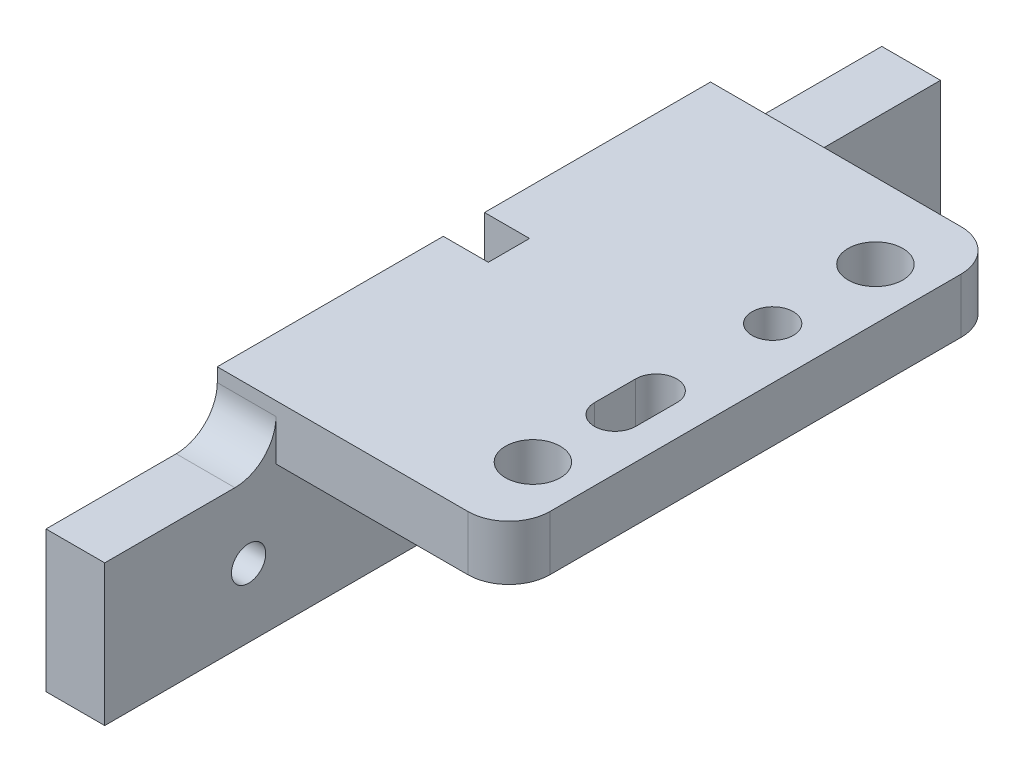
ISO-10303-21;
HEADER;
FILE_DESCRIPTION(('STEP AP214'),'2;1');
FILE_NAME('part.step','',(''),(''),'','','');
FILE_SCHEMA(('AUTOMOTIVE_DESIGN { 1 0 10303 214 1 1 1 1 }'));
ENDSEC;
DATA;
#1=APPLICATION_CONTEXT('core data for automotive mechanical design processes');
#2=APPLICATION_PROTOCOL_DEFINITION('international standard','automotive_design',2000,#1);
#3=PRODUCT_CONTEXT('',#1,'mechanical');
#4=PRODUCT('Part','Part','',(#3));
#5=PRODUCT_RELATED_PRODUCT_CATEGORY('part','',(#4));
#6=PRODUCT_DEFINITION_FORMATION('','',#4);
#7=PRODUCT_DEFINITION_CONTEXT('part definition',#1,'design');
#8=PRODUCT_DEFINITION('design','',#6,#7);
#9=PRODUCT_DEFINITION_SHAPE('','',#8);
#10=(LENGTH_UNIT() NAMED_UNIT(*) SI_UNIT(.MILLI.,.METRE.));
#11=(NAMED_UNIT(*) PLANE_ANGLE_UNIT() SI_UNIT($,.RADIAN.));
#12=(NAMED_UNIT(*) SI_UNIT($,.STERADIAN.) SOLID_ANGLE_UNIT());
#13=UNCERTAINTY_MEASURE_WITH_UNIT(LENGTH_MEASURE(1.E-05),#10,'distance_accuracy_value','');
#14=(GEOMETRIC_REPRESENTATION_CONTEXT(3) GLOBAL_UNCERTAINTY_ASSIGNED_CONTEXT((#13)) GLOBAL_UNIT_ASSIGNED_CONTEXT((#10,
#11,#12)) REPRESENTATION_CONTEXT('',''));
#15=CARTESIAN_POINT('',(0.,0.,0.));
#16=DIRECTION('',(0.,0.,1.));
#17=DIRECTION('',(1.,0.,0.));
#18=AXIS2_PLACEMENT_3D('',#15,#16,#17);
#19=CARTESIAN_POINT('',(-10.643,-7.1435,30.5));
#20=DIRECTION('',(1.,0.,0.));
#21=DIRECTION('',(0.,0.,-1.));
#22=AXIS2_PLACEMENT_3D('',#19,#20,#21);
#23=PLANE('',#22);
#24=CARTESIAN_POINT('',(-10.643,-2.14349999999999,-20.));
#25=DIRECTION('',(1.,0.,0.));
#26=DIRECTION('',(0.,0.,-1.));
#27=AXIS2_PLACEMENT_3D('',#24,#25,#26);
#28=CIRCLE('',#27,1.25);
#29=CARTESIAN_POINT('',(-10.643,-2.14349999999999,-21.25));
#30=VERTEX_POINT('',#29);
#31=EDGE_CURVE('E319',#30,#30,#28,.T.);
#32=ORIENTED_EDGE('',*,*,#31,.T.);
#33=EDGE_LOOP('',(#32));
#34=FACE_BOUND('',#33,.T.);
#35=DIRECTION('',(0.,-1.,0.));
#36=VECTOR('',#35,1.);
#37=CARTESIAN_POINT('',(-10.643,7.1435,-18.));
#38=LINE('',#37,#36);
#39=CARTESIAN_POINT('',(-10.643,7.1435,-18.));
#40=VERTEX_POINT('',#39);
#41=CARTESIAN_POINT('',(-10.643,6.1435,-18.));
#42=VERTEX_POINT('',#41);
#43=EDGE_CURVE('E259',#40,#42,#38,.T.);
#44=ORIENTED_EDGE('',*,*,#43,.T.);
#45=CARTESIAN_POINT('',(-10.643,6.1435,-21.));
#46=DIRECTION('',(1.,0.,0.));
#47=DIRECTION('',(0.,0.,-1.));
#48=AXIS2_PLACEMENT_3D('',#45,#46,#47);
#49=CIRCLE('',#48,3.);
#50=CARTESIAN_POINT('',(-10.643,3.1435,-21.));
#51=VERTEX_POINT('',#50);
#52=EDGE_CURVE('E455',#42,#51,#49,.T.);
#53=ORIENTED_EDGE('',*,*,#52,.T.);
#54=DIRECTION('',(0.,0.,-1.));
#55=VECTOR('',#54,1.);
#56=CARTESIAN_POINT('',(-10.643,3.1435,-30.5));
#57=LINE('',#56,#55);
#58=CARTESIAN_POINT('',(-10.643,3.1435,-30.5));
#59=VERTEX_POINT('',#58);
#60=EDGE_CURVE('E263',#51,#59,#57,.T.);
#61=ORIENTED_EDGE('',*,*,#60,.T.);
#62=DIRECTION('',(0.,-1.,0.));
#63=VECTOR('',#62,1.);
#64=CARTESIAN_POINT('',(-10.643,-7.1435,-30.5));
#65=LINE('',#64,#63);
#66=CARTESIAN_POINT('',(-10.643,-7.1435,-30.5));
#67=VERTEX_POINT('',#66);
#68=EDGE_CURVE('E372',#59,#67,#65,.T.);
#69=ORIENTED_EDGE('',*,*,#68,.T.);
#70=DIRECTION('',(0.,0.,-1.));
#71=VECTOR('',#70,1.);
#72=CARTESIAN_POINT('',(-10.643,-7.1435,30.5));
#73=LINE('',#72,#71);
#74=CARTESIAN_POINT('',(-10.643,-7.1435,-1.50495));
#75=VERTEX_POINT('',#74);
#76=EDGE_CURVE('E388',#75,#67,#73,.T.);
#77=ORIENTED_EDGE('',*,*,#76,.F.);
#78=DIRECTION('',(0.,-1.,0.));
#79=VECTOR('',#78,1.);
#80=CARTESIAN_POINT('',(-10.643,7.1435,-1.50495));
#81=LINE('',#80,#79);
#82=CARTESIAN_POINT('',(-10.643,7.1435,-1.50495));
#83=VERTEX_POINT('',#82);
#84=EDGE_CURVE('E277',#83,#75,#81,.T.);
#85=ORIENTED_EDGE('',*,*,#84,.F.);
#86=DIRECTION('',(0.,0.,-1.));
#87=VECTOR('',#86,1.);
#88=CARTESIAN_POINT('',(-10.643,7.1435,30.5));
#89=LINE('',#88,#87);
#90=EDGE_CURVE('E398',#83,#40,#89,.T.);
#91=ORIENTED_EDGE('',*,*,#90,.T.);
#92=EDGE_LOOP('',(#44,#53,#61,#69,#77,#85,#91));
#93=FACE_BOUND('',#92,.T.);
#94=ADVANCED_FACE('F44',(#34,#93),#23,.F.);
#95=CARTESIAN_POINT('',(10.643,-7.1435,30.5));
#96=DIRECTION('',(-1.,0.,0.));
#97=DIRECTION('',(0.,0.,1.));
#98=AXIS2_PLACEMENT_3D('',#95,#96,#97);
#99=PLANE('',#98);
#100=DIRECTION('',(0.,0.,-1.));
#101=VECTOR('',#100,1.);
#102=CARTESIAN_POINT('',(10.643,7.1435,30.5));
#103=LINE('',#102,#101);
#104=CARTESIAN_POINT('',(10.643,7.1435,15.));
#105=VERTEX_POINT('',#104);
#106=CARTESIAN_POINT('',(10.643,7.1435,-15.));
#107=VERTEX_POINT('',#106);
#108=EDGE_CURVE('E402',#105,#107,#103,.T.);
#109=ORIENTED_EDGE('',*,*,#108,.F.);
#110=DIRECTION('',(0.,-1.,0.));
#111=VECTOR('',#110,1.);
#112=CARTESIAN_POINT('',(10.643,-7.1435,15.));
#113=LINE('',#112,#111);
#114=CARTESIAN_POINT('',(10.643,3.1435,15.));
#115=VERTEX_POINT('',#114);
#116=EDGE_CURVE('E408',#105,#115,#113,.T.);
#117=ORIENTED_EDGE('',*,*,#116,.T.);
#118=DIRECTION('',(0.,0.,1.));
#119=VECTOR('',#118,1.);
#120=CARTESIAN_POINT('',(10.643,3.1435,-30.5));
#121=LINE('',#120,#119);
#122=CARTESIAN_POINT('',(10.643,3.1435,-15.));
#123=VERTEX_POINT('',#122);
#124=EDGE_CURVE('E365',#123,#115,#121,.T.);
#125=ORIENTED_EDGE('',*,*,#124,.F.);
#126=DIRECTION('',(0.,-1.,0.));
#127=VECTOR('',#126,1.);
#128=CARTESIAN_POINT('',(10.643,-7.1435,-15.));
#129=LINE('',#128,#127);
#130=EDGE_CURVE('E406',#123,#107,#129,.F.);
#131=ORIENTED_EDGE('',*,*,#130,.T.);
#132=EDGE_LOOP('',(#109,#117,#125,#131));
#133=FACE_BOUND('',#132,.T.);
#134=ADVANCED_FACE('F534',(#133),#99,.F.);
#135=CARTESIAN_POINT('',(-10.643,7.1435,30.5));
#136=DIRECTION('',(0.,-1.,0.));
#137=DIRECTION('',(0.,0.,-1.));
#138=AXIS2_PLACEMENT_3D('',#135,#136,#137);
#139=PLANE('',#138);
#140=CARTESIAN_POINT('',(6.89300000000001,7.1435,-5.));
#141=DIRECTION('',(0.,-1.,0.));
#142=DIRECTION('',(-1.,0.,0.));
#143=AXIS2_PLACEMENT_3D('',#140,#141,#142);
#144=CIRCLE('',#143,1.50495);
#145=CARTESIAN_POINT('',(5.38805000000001,7.1435,-5.));
#146=VERTEX_POINT('',#145);
#147=EDGE_CURVE('E273',#146,#146,#144,.T.);
#148=ORIENTED_EDGE('',*,*,#147,.T.);
#149=EDGE_LOOP('',(#148));
#150=FACE_BOUND('',#149,.T.);
#151=CARTESIAN_POINT('',(6.89300000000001,7.14350000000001,6.5));
#152=DIRECTION('',(0.,-1.,0.));
#153=DIRECTION('',(1.,0.,0.));
#154=AXIS2_PLACEMENT_3D('',#151,#152,#153);
#155=CIRCLE('',#154,1.50495);
#156=CARTESIAN_POINT('',(8.39795000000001,7.1435,6.5));
#157=VERTEX_POINT('',#156);
#158=CARTESIAN_POINT('',(5.38805000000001,7.14350000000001,6.5));
#159=VERTEX_POINT('',#158);
#160=EDGE_CURVE('E60',#157,#159,#155,.T.);
#161=ORIENTED_EDGE('',*,*,#160,.T.);
#162=DIRECTION('',(0.,0.,-1.));
#163=VECTOR('',#162,1.);
#164=CARTESIAN_POINT('',(5.38805000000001,7.14350000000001,3.5));
#165=LINE('',#164,#163);
#166=CARTESIAN_POINT('',(5.38805000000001,7.14350000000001,3.5));
#167=VERTEX_POINT('',#166);
#168=EDGE_CURVE('E210',#159,#167,#165,.T.);
#169=ORIENTED_EDGE('',*,*,#168,.T.);
#170=CARTESIAN_POINT('',(6.89300000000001,7.14350000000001,3.5));
#171=DIRECTION('',(0.,-1.,0.));
#172=DIRECTION('',(1.,0.,0.));
#173=AXIS2_PLACEMENT_3D('',#170,#171,#172);
#174=CIRCLE('',#173,1.50495);
#175=CARTESIAN_POINT('',(8.39795000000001,7.14350000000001,3.5));
#176=VERTEX_POINT('',#175);
#177=EDGE_CURVE('E204',#167,#176,#174,.T.);
#178=ORIENTED_EDGE('',*,*,#177,.T.);
#179=DIRECTION('',(0.,0.,1.));
#180=VECTOR('',#179,1.);
#181=CARTESIAN_POINT('',(8.39795000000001,7.14350000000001,3.5));
#182=LINE('',#181,#180);
#183=EDGE_CURVE('E196',#176,#157,#182,.T.);
#184=ORIENTED_EDGE('',*,*,#183,.T.);
#185=EDGE_LOOP('',(#161,#169,#178,#184));
#186=FACE_BOUND('',#185,.T.);
#187=CARTESIAN_POINT('',(-10.643,7.14349999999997,18.));
#188=VERTEX_POINT('',#187);
#189=CARTESIAN_POINT('',(-10.643,7.1435,1.50495));
#190=VERTEX_POINT('',#189);
#191=EDGE_CURVE('E399',#188,#190,#89,.T.);
#192=ORIENTED_EDGE('',*,*,#191,.F.);
#193=DIRECTION('',(1.,0.,0.));
#194=VECTOR('',#193,1.);
#195=CARTESIAN_POINT('',(10.643,7.1435,18.));
#196=LINE('',#195,#194);
#197=CARTESIAN_POINT('',(7.643,7.1435,18.));
#198=VERTEX_POINT('',#197);
#199=EDGE_CURVE('E354',#188,#198,#196,.T.);
#200=ORIENTED_EDGE('',*,*,#199,.T.);
#201=CARTESIAN_POINT('',(7.643,7.1435,15.));
#202=DIRECTION('',(0.,-1.,0.));
#203=DIRECTION('',(0.,0.,-1.));
#204=AXIS2_PLACEMENT_3D('',#201,#202,#203);
#205=CIRCLE('',#204,3.);
#206=EDGE_CURVE('E424',#198,#105,#205,.F.);
#207=ORIENTED_EDGE('',*,*,#206,.T.);
#208=ORIENTED_EDGE('',*,*,#108,.T.);
#209=CARTESIAN_POINT('',(7.643,7.1435,-15.));
#210=DIRECTION('',(0.,-1.,0.));
#211=DIRECTION('',(0.,0.,-1.));
#212=AXIS2_PLACEMENT_3D('',#209,#210,#211);
#213=CIRCLE('',#212,3.);
#214=CARTESIAN_POINT('',(7.643,7.1435,-18.));
#215=VERTEX_POINT('',#214);
#216=EDGE_CURVE('E421',#107,#215,#213,.F.);
#217=ORIENTED_EDGE('',*,*,#216,.T.);
#218=DIRECTION('',(-1.,0.,0.));
#219=VECTOR('',#218,1.);
#220=CARTESIAN_POINT('',(10.643,7.1435,-18.));
#221=LINE('',#220,#219);
#222=EDGE_CURVE('E347',#215,#40,#221,.T.);
#223=ORIENTED_EDGE('',*,*,#222,.T.);
#224=ORIENTED_EDGE('',*,*,#90,.F.);
#225=DIRECTION('',(-1.,0.,0.));
#226=VECTOR('',#225,1.);
#227=CARTESIAN_POINT('',(8.24361187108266,7.1435,-1.50495));
#228=LINE('',#227,#226);
#229=CARTESIAN_POINT('',(-7.357,7.1435,-1.50495));
#230=VERTEX_POINT('',#229);
#231=EDGE_CURVE('E285',#230,#83,#228,.T.);
#232=ORIENTED_EDGE('',*,*,#231,.F.);
#233=DIRECTION('',(0.,0.,1.));
#234=VECTOR('',#233,1.);
#235=CARTESIAN_POINT('',(-7.357,7.1435,-1.50495));
#236=LINE('',#235,#234);
#237=CARTESIAN_POINT('',(-7.357,7.1435,1.50495));
#238=VERTEX_POINT('',#237);
#239=EDGE_CURVE('E284',#230,#238,#236,.T.);
#240=ORIENTED_EDGE('',*,*,#239,.T.);
#241=DIRECTION('',(-1.,0.,0.));
#242=VECTOR('',#241,1.);
#243=CARTESIAN_POINT('',(8.24361187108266,7.1435,1.50495));
#244=LINE('',#243,#242);
#245=EDGE_CURVE('E302',#238,#190,#244,.T.);
#246=ORIENTED_EDGE('',*,*,#245,.T.);
#247=EDGE_LOOP('',(#192,#200,#207,#208,#217,#223,#224,#232,#240,#246));
#248=FACE_BOUND('',#247,.T.);
#249=CARTESIAN_POINT('',(6.89300000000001,7.1435,-12.5));
#250=DIRECTION('',(0.,-1.,0.));
#251=DIRECTION('',(0.,0.,-1.));
#252=AXIS2_PLACEMENT_3D('',#249,#250,#251);
#253=CIRCLE('',#252,2.);
#254=CARTESIAN_POINT('',(6.89300000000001,7.1435,-14.5));
#255=VERTEX_POINT('',#254);
#256=EDGE_CURVE('E334',#255,#255,#253,.T.);
#257=ORIENTED_EDGE('',*,*,#256,.T.);
#258=EDGE_LOOP('',(#257));
#259=FACE_BOUND('',#258,.T.);
#260=CARTESIAN_POINT('',(6.89300000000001,7.1435,12.5));
#261=DIRECTION('',(0.,-1.,0.));
#262=DIRECTION('',(0.,0.,-1.));
#263=AXIS2_PLACEMENT_3D('',#260,#261,#262);
#264=CIRCLE('',#263,2.);
#265=CARTESIAN_POINT('',(6.89300000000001,7.1435,10.5));
#266=VERTEX_POINT('',#265);
#267=EDGE_CURVE('E342',#266,#266,#264,.T.);
#268=ORIENTED_EDGE('',*,*,#267,.T.);
#269=EDGE_LOOP('',(#268));
#270=FACE_BOUND('',#269,.T.);
#271=ADVANCED_FACE('F212',(#150,#186,#248,#259,#270),#139,.F.);
#272=CARTESIAN_POINT('',(-10.643,-2.1435,20.));
#273=DIRECTION('',(1.,0.,0.));
#274=DIRECTION('',(0.,0.,-1.));
#275=AXIS2_PLACEMENT_3D('',#272,#273,#274);
#276=CIRCLE('',#275,1.25);
#277=CARTESIAN_POINT('',(-10.643,-2.1435,18.75));
#278=VERTEX_POINT('',#277);
#279=EDGE_CURVE('E327',#278,#278,#276,.T.);
#280=ORIENTED_EDGE('',*,*,#279,.T.);
#281=EDGE_LOOP('',(#280));
#282=FACE_BOUND('',#281,.T.);
#283=DIRECTION('',(0.,0.,-1.));
#284=VECTOR('',#283,1.);
#285=CARTESIAN_POINT('',(-10.643,3.14349999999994,30.5));
#286=LINE('',#285,#284);
#287=CARTESIAN_POINT('',(-10.643,3.14349999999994,30.5));
#288=VERTEX_POINT('',#287);
#289=CARTESIAN_POINT('',(-10.643,3.14349999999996,21.));
#290=VERTEX_POINT('',#289);
#291=EDGE_CURVE('E245',#288,#290,#286,.T.);
#292=ORIENTED_EDGE('',*,*,#291,.T.);
#293=CARTESIAN_POINT('',(-10.643,6.14349999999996,21.));
#294=DIRECTION('',(1.,0.,0.));
#295=DIRECTION('',(0.,0.,-1.));
#296=AXIS2_PLACEMENT_3D('',#293,#294,#295);
#297=CIRCLE('',#296,3.);
#298=CARTESIAN_POINT('',(-10.643,6.14349999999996,18.));
#299=VERTEX_POINT('',#298);
#300=EDGE_CURVE('E12',#290,#299,#297,.T.);
#301=ORIENTED_EDGE('',*,*,#300,.T.);
#302=DIRECTION('',(0.,1.,0.));
#303=VECTOR('',#302,1.);
#304=CARTESIAN_POINT('',(-10.643,7.14349999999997,18.));
#305=LINE('',#304,#303);
#306=EDGE_CURVE('E249',#299,#188,#305,.T.);
#307=ORIENTED_EDGE('',*,*,#306,.T.);
#308=ORIENTED_EDGE('',*,*,#191,.T.);
#309=DIRECTION('',(0.,1.,0.));
#310=VECTOR('',#309,1.);
#311=CARTESIAN_POINT('',(-10.643,7.1435,1.50495));
#312=LINE('',#311,#310);
#313=CARTESIAN_POINT('',(-10.643,-7.1435,1.50495));
#314=VERTEX_POINT('',#313);
#315=EDGE_CURVE('E295',#314,#190,#312,.T.);
#316=ORIENTED_EDGE('',*,*,#315,.F.);
#317=CARTESIAN_POINT('',(-10.643,-7.1435,30.5));
#318=VERTEX_POINT('',#317);
#319=EDGE_CURVE('E394',#318,#314,#73,.T.);
#320=ORIENTED_EDGE('',*,*,#319,.F.);
#321=DIRECTION('',(0.,-1.,0.));
#322=VECTOR('',#321,1.);
#323=CARTESIAN_POINT('',(-10.643,-7.1435,30.5));
#324=LINE('',#323,#322);
#325=EDGE_CURVE('E380',#288,#318,#324,.T.);
#326=ORIENTED_EDGE('',*,*,#325,.F.);
#327=EDGE_LOOP('',(#292,#301,#307,#308,#316,#320,#326));
#328=FACE_BOUND('',#327,.T.);
#329=ADVANCED_FACE('F472',(#282,#328),#23,.F.);
#330=CARTESIAN_POINT('',(-10.643,-7.1435,30.5));
#331=DIRECTION('',(0.,1.,0.));
#332=DIRECTION('',(0.,0.,1.));
#333=AXIS2_PLACEMENT_3D('',#330,#331,#332);
#334=PLANE('',#333);
#335=DIRECTION('',(0.,0.,-1.));
#336=VECTOR('',#335,1.);
#337=CARTESIAN_POINT('',(-7.357,-7.1435,-1.50495));
#338=LINE('',#337,#336);
#339=CARTESIAN_POINT('',(-7.357,-7.1435,1.50495));
#340=VERTEX_POINT('',#339);
#341=CARTESIAN_POINT('',(-7.357,-7.1435,-1.50495));
#342=VERTEX_POINT('',#341);
#343=EDGE_CURVE('E292',#340,#342,#338,.T.);
#344=ORIENTED_EDGE('',*,*,#343,.T.);
#345=DIRECTION('',(-1.,0.,0.));
#346=VECTOR('',#345,1.);
#347=CARTESIAN_POINT('',(8.24361187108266,-7.1435,-1.50495));
#348=LINE('',#347,#346);
#349=EDGE_CURVE('E299',#342,#75,#348,.T.);
#350=ORIENTED_EDGE('',*,*,#349,.T.);
#351=ORIENTED_EDGE('',*,*,#76,.T.);
#352=DIRECTION('',(1.,0.,0.));
#353=VECTOR('',#352,1.);
#354=CARTESIAN_POINT('',(-10.643,-7.1435,-30.5));
#355=LINE('',#354,#353);
#356=CARTESIAN_POINT('',(-6.357,-7.1435,-30.5));
#357=VERTEX_POINT('',#356);
#358=EDGE_CURVE('E384',#67,#357,#355,.T.);
#359=ORIENTED_EDGE('',*,*,#358,.T.);
#360=DIRECTION('',(0.,0.,1.));
#361=VECTOR('',#360,1.);
#362=CARTESIAN_POINT('',(-6.357,-7.1435,-30.5));
#363=LINE('',#362,#361);
#364=CARTESIAN_POINT('',(-6.357,-7.1435,30.5));
#365=VERTEX_POINT('',#364);
#366=EDGE_CURVE('E368',#357,#365,#363,.T.);
#367=ORIENTED_EDGE('',*,*,#366,.T.);
#368=DIRECTION('',(1.,0.,0.));
#369=VECTOR('',#368,1.);
#370=CARTESIAN_POINT('',(-10.643,-7.1435,30.5));
#371=LINE('',#370,#369);
#372=EDGE_CURVE('E383',#318,#365,#371,.T.);
#373=ORIENTED_EDGE('',*,*,#372,.F.);
#374=ORIENTED_EDGE('',*,*,#319,.T.);
#375=DIRECTION('',(-1.,0.,0.));
#376=VECTOR('',#375,1.);
#377=CARTESIAN_POINT('',(8.24361187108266,-7.1435,1.50495));
#378=LINE('',#377,#376);
#379=EDGE_CURVE('E306',#340,#314,#378,.T.);
#380=ORIENTED_EDGE('',*,*,#379,.F.);
#381=EDGE_LOOP('',(#344,#350,#351,#359,#367,#373,#374,#380));
#382=FACE_BOUND('',#381,.T.);
#383=ADVANCED_FACE('F489',(#382),#334,.F.);
#384=CARTESIAN_POINT('',(0.,0.,30.5));
#385=DIRECTION('',(0.,0.,-1.));
#386=DIRECTION('',(-1.,0.,0.));
#387=AXIS2_PLACEMENT_3D('',#384,#385,#386);
#388=PLANE('',#387);
#389=DIRECTION('',(0.,-1.,0.));
#390=VECTOR('',#389,1.);
#391=CARTESIAN_POINT('',(-6.357,-7.1435,30.5));
#392=LINE('',#391,#390);
#393=CARTESIAN_POINT('',(-6.357,3.14349999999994,30.5));
#394=VERTEX_POINT('',#393);
#395=EDGE_CURVE('E358',#394,#365,#392,.T.);
#396=ORIENTED_EDGE('',*,*,#395,.F.);
#397=DIRECTION('',(1.,0.,0.));
#398=VECTOR('',#397,1.);
#399=CARTESIAN_POINT('',(-10.643,3.14349999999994,30.5));
#400=LINE('',#399,#398);
#401=EDGE_CURVE('E252',#288,#394,#400,.T.);
#402=ORIENTED_EDGE('',*,*,#401,.F.);
#403=ORIENTED_EDGE('',*,*,#325,.T.);
#404=ORIENTED_EDGE('',*,*,#372,.T.);
#405=EDGE_LOOP('',(#396,#402,#403,#404));
#406=FACE_BOUND('',#405,.T.);
#407=ADVANCED_FACE('F492',(#406),#388,.F.);
#408=CARTESIAN_POINT('',(0.,0.,-30.5));
#409=DIRECTION('',(0.,0.,-1.));
#410=DIRECTION('',(-1.,0.,0.));
#411=AXIS2_PLACEMENT_3D('',#408,#409,#410);
#412=PLANE('',#411);
#413=DIRECTION('',(1.,0.,0.));
#414=VECTOR('',#413,1.);
#415=CARTESIAN_POINT('',(-10.643,3.1435,-30.5));
#416=LINE('',#415,#414);
#417=CARTESIAN_POINT('',(-6.357,3.1435,-30.5));
#418=VERTEX_POINT('',#417);
#419=EDGE_CURVE('E266',#59,#418,#416,.T.);
#420=ORIENTED_EDGE('',*,*,#419,.T.);
#421=DIRECTION('',(0.,-1.,0.));
#422=VECTOR('',#421,1.);
#423=CARTESIAN_POINT('',(-6.357,-7.1435,-30.5));
#424=LINE('',#423,#422);
#425=EDGE_CURVE('E362',#418,#357,#424,.T.);
#426=ORIENTED_EDGE('',*,*,#425,.T.);
#427=ORIENTED_EDGE('',*,*,#358,.F.);
#428=ORIENTED_EDGE('',*,*,#68,.F.);
#429=EDGE_LOOP('',(#420,#426,#427,#428));
#430=FACE_BOUND('',#429,.T.);
#431=ADVANCED_FACE('F500',(#430),#412,.T.);
#432=CARTESIAN_POINT('',(-6.357,-7.1435,-30.5));
#433=DIRECTION('',(-1.,0.,0.));
#434=DIRECTION('',(0.,0.,1.));
#435=AXIS2_PLACEMENT_3D('',#432,#433,#434);
#436=PLANE('',#435);
#437=CARTESIAN_POINT('',(-6.357,-2.14349999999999,-20.));
#438=DIRECTION('',(1.,0.,0.));
#439=DIRECTION('',(0.,0.,-1.));
#440=AXIS2_PLACEMENT_3D('',#437,#438,#439);
#441=CIRCLE('',#440,1.25);
#442=CARTESIAN_POINT('',(-6.357,-2.14349999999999,-21.25));
#443=VERTEX_POINT('',#442);
#444=EDGE_CURVE('E315',#443,#443,#441,.T.);
#445=ORIENTED_EDGE('',*,*,#444,.F.);
#446=EDGE_LOOP('',(#445));
#447=FACE_BOUND('',#446,.T.);
#448=CARTESIAN_POINT('',(-6.357,-2.1435,20.));
#449=DIRECTION('',(1.,0.,0.));
#450=DIRECTION('',(0.,0.,-1.));
#451=AXIS2_PLACEMENT_3D('',#448,#449,#450);
#452=CIRCLE('',#451,1.25);
#453=CARTESIAN_POINT('',(-6.357,-2.1435,18.75));
#454=VERTEX_POINT('',#453);
#455=EDGE_CURVE('E323',#454,#454,#452,.T.);
#456=ORIENTED_EDGE('',*,*,#455,.F.);
#457=EDGE_LOOP('',(#456));
#458=FACE_BOUND('',#457,.T.);
#459=DIRECTION('',(0.,0.,1.));
#460=VECTOR('',#459,1.);
#461=CARTESIAN_POINT('',(-6.357,3.1435,-30.5));
#462=LINE('',#461,#460);
#463=CARTESIAN_POINT('',(-6.357,3.1435,-18.));
#464=VERTEX_POINT('',#463);
#465=CARTESIAN_POINT('',(-6.357,3.1435,18.));
#466=VERTEX_POINT('',#465);
#467=EDGE_CURVE('E373',#464,#466,#462,.T.);
#468=ORIENTED_EDGE('',*,*,#467,.T.);
#469=DIRECTION('',(0.,-1.,0.));
#470=VECTOR('',#469,1.);
#471=CARTESIAN_POINT('',(-6.357,-7.1435,18.));
#472=LINE('',#471,#470);
#473=CARTESIAN_POINT('',(-6.357,6.14349999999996,18.));
#474=VERTEX_POINT('',#473);
#475=EDGE_CURVE('E442',#474,#466,#472,.T.);
#476=ORIENTED_EDGE('',*,*,#475,.F.);
#477=CARTESIAN_POINT('',(-6.357,6.14349999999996,21.));
#478=DIRECTION('',(-1.,0.,0.));
#479=DIRECTION('',(0.,0.,1.));
#480=AXIS2_PLACEMENT_3D('',#477,#478,#479);
#481=CIRCLE('',#480,3.);
#482=CARTESIAN_POINT('',(-6.357,3.14349999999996,21.));
#483=VERTEX_POINT('',#482);
#484=EDGE_CURVE('E53',#474,#483,#481,.T.);
#485=ORIENTED_EDGE('',*,*,#484,.T.);
#486=DIRECTION('',(0.,0.,-1.));
#487=VECTOR('',#486,1.);
#488=CARTESIAN_POINT('',(-6.357,3.14349999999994,30.5));
#489=LINE('',#488,#487);
#490=EDGE_CURVE('E238',#394,#483,#489,.T.);
#491=ORIENTED_EDGE('',*,*,#490,.F.);
#492=ORIENTED_EDGE('',*,*,#395,.T.);
#493=ORIENTED_EDGE('',*,*,#366,.F.);
#494=ORIENTED_EDGE('',*,*,#425,.F.);
#495=DIRECTION('',(0.,0.,-1.));
#496=VECTOR('',#495,1.);
#497=CARTESIAN_POINT('',(-6.357,3.1435,-30.5));
#498=LINE('',#497,#496);
#499=CARTESIAN_POINT('',(-6.357,3.1435,-21.));
#500=VERTEX_POINT('',#499);
#501=EDGE_CURVE('E258',#500,#418,#498,.T.);
#502=ORIENTED_EDGE('',*,*,#501,.F.);
#503=CARTESIAN_POINT('',(-6.357,6.1435,-21.));
#504=DIRECTION('',(-1.,0.,0.));
#505=DIRECTION('',(0.,0.,1.));
#506=AXIS2_PLACEMENT_3D('',#503,#504,#505);
#507=CIRCLE('',#506,3.);
#508=CARTESIAN_POINT('',(-6.357,6.1435,-18.));
#509=VERTEX_POINT('',#508);
#510=EDGE_CURVE('E452',#500,#509,#507,.T.);
#511=ORIENTED_EDGE('',*,*,#510,.T.);
#512=DIRECTION('',(0.,1.,0.));
#513=VECTOR('',#512,1.);
#514=CARTESIAN_POINT('',(-6.357,-7.1435,-18.));
#515=LINE('',#514,#513);
#516=EDGE_CURVE('E438',#464,#509,#515,.T.);
#517=ORIENTED_EDGE('',*,*,#516,.F.);
#518=EDGE_LOOP('',(#468,#476,#485,#491,#492,#493,#494,#502,#511,#517));
#519=FACE_BOUND('',#518,.T.);
#520=ADVANCED_FACE('F461',(#447,#458,#519),#436,.F.);
#521=CARTESIAN_POINT('',(10.643,3.1435,-30.5));
#522=DIRECTION('',(0.,1.,0.));
#523=DIRECTION('',(-1.,0.,0.));
#524=AXIS2_PLACEMENT_3D('',#521,#522,#523);
#525=PLANE('',#524);
#526=CARTESIAN_POINT('',(6.89300000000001,3.1435,-5.));
#527=DIRECTION('',(0.,-1.,0.));
#528=DIRECTION('',(-1.,0.,0.));
#529=AXIS2_PLACEMENT_3D('',#526,#527,#528);
#530=CIRCLE('',#529,1.50495);
#531=CARTESIAN_POINT('',(5.38805000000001,3.1435,-5.));
#532=VERTEX_POINT('',#531);
#533=EDGE_CURVE('E272',#532,#532,#530,.T.);
#534=ORIENTED_EDGE('',*,*,#533,.F.);
#535=EDGE_LOOP('',(#534));
#536=FACE_BOUND('',#535,.T.);
#537=DIRECTION('',(0.,0.,1.));
#538=VECTOR('',#537,1.);
#539=CARTESIAN_POINT('',(8.39795000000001,3.1435,3.5));
#540=LINE('',#539,#538);
#541=CARTESIAN_POINT('',(8.39795000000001,3.1435,3.5));
#542=VERTEX_POINT('',#541);
#543=CARTESIAN_POINT('',(8.39795000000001,3.1435,6.5));
#544=VERTEX_POINT('',#543);
#545=EDGE_CURVE('E229',#542,#544,#540,.T.);
#546=ORIENTED_EDGE('',*,*,#545,.F.);
#547=CARTESIAN_POINT('',(6.89300000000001,3.1435,3.5));
#548=DIRECTION('',(0.,-1.,0.));
#549=DIRECTION('',(1.,0.,0.));
#550=AXIS2_PLACEMENT_3D('',#547,#548,#549);
#551=CIRCLE('',#550,1.50495);
#552=CARTESIAN_POINT('',(5.38805000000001,3.1435,3.5));
#553=VERTEX_POINT('',#552);
#554=EDGE_CURVE('E68',#553,#542,#551,.T.);
#555=ORIENTED_EDGE('',*,*,#554,.F.);
#556=DIRECTION('',(0.,0.,-1.));
#557=VECTOR('',#556,1.);
#558=CARTESIAN_POINT('',(5.38805000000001,3.1435,3.5));
#559=LINE('',#558,#557);
#560=CARTESIAN_POINT('',(5.38805000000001,3.1435,6.5));
#561=VERTEX_POINT('',#560);
#562=EDGE_CURVE('E215',#561,#553,#559,.T.);
#563=ORIENTED_EDGE('',*,*,#562,.F.);
#564=CARTESIAN_POINT('',(6.89300000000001,3.1435,6.5));
#565=DIRECTION('',(0.,-1.,0.));
#566=DIRECTION('',(1.,0.,0.));
#567=AXIS2_PLACEMENT_3D('',#564,#565,#566);
#568=CIRCLE('',#567,1.50495);
#569=EDGE_CURVE('E220',#544,#561,#568,.T.);
#570=ORIENTED_EDGE('',*,*,#569,.F.);
#571=EDGE_LOOP('',(#546,#555,#563,#570));
#572=FACE_BOUND('',#571,.T.);
#573=CARTESIAN_POINT('',(6.89300000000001,3.1435,-12.5));
#574=DIRECTION('',(0.,-1.,0.));
#575=DIRECTION('',(0.,0.,-1.));
#576=AXIS2_PLACEMENT_3D('',#573,#574,#575);
#577=CIRCLE('',#576,2.);
#578=CARTESIAN_POINT('',(6.89300000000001,3.1435,-14.5));
#579=VERTEX_POINT('',#578);
#580=EDGE_CURVE('E330',#579,#579,#577,.T.);
#581=ORIENTED_EDGE('',*,*,#580,.F.);
#582=EDGE_LOOP('',(#581));
#583=FACE_BOUND('',#582,.T.);
#584=CARTESIAN_POINT('',(6.89300000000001,3.1435,12.5));
#585=DIRECTION('',(0.,-1.,0.));
#586=DIRECTION('',(0.,0.,-1.));
#587=AXIS2_PLACEMENT_3D('',#584,#585,#586);
#588=CIRCLE('',#587,2.);
#589=CARTESIAN_POINT('',(6.89300000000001,3.1435,10.5));
#590=VERTEX_POINT('',#589);
#591=EDGE_CURVE('E338',#590,#590,#588,.T.);
#592=ORIENTED_EDGE('',*,*,#591,.F.);
#593=EDGE_LOOP('',(#592));
#594=FACE_BOUND('',#593,.T.);
#595=ORIENTED_EDGE('',*,*,#124,.T.);
#596=CARTESIAN_POINT('',(7.643,3.1435,15.));
#597=DIRECTION('',(0.,1.,0.));
#598=DIRECTION('',(-1.,0.,0.));
#599=AXIS2_PLACEMENT_3D('',#596,#597,#598);
#600=CIRCLE('',#599,3.);
#601=CARTESIAN_POINT('',(7.643,3.1435,18.));
#602=VERTEX_POINT('',#601);
#603=EDGE_CURVE('E415',#115,#602,#600,.F.);
#604=ORIENTED_EDGE('',*,*,#603,.T.);
#605=DIRECTION('',(1.,0.,0.));
#606=VECTOR('',#605,1.);
#607=CARTESIAN_POINT('',(10.643,3.1435,18.));
#608=LINE('',#607,#606);
#609=EDGE_CURVE('E350',#466,#602,#608,.T.);
#610=ORIENTED_EDGE('',*,*,#609,.F.);
#611=ORIENTED_EDGE('',*,*,#467,.F.);
#612=DIRECTION('',(-1.,0.,0.));
#613=VECTOR('',#612,1.);
#614=CARTESIAN_POINT('',(10.643,3.1435,-18.));
#615=LINE('',#614,#613);
#616=CARTESIAN_POINT('',(7.643,3.1435,-18.));
#617=VERTEX_POINT('',#616);
#618=EDGE_CURVE('E346',#617,#464,#615,.T.);
#619=ORIENTED_EDGE('',*,*,#618,.F.);
#620=CARTESIAN_POINT('',(7.643,3.1435,-15.));
#621=DIRECTION('',(0.,1.,0.));
#622=DIRECTION('',(-1.,0.,0.));
#623=AXIS2_PLACEMENT_3D('',#620,#621,#622);
#624=CIRCLE('',#623,3.);
#625=EDGE_CURVE('E412',#617,#123,#624,.F.);
#626=ORIENTED_EDGE('',*,*,#625,.T.);
#627=EDGE_LOOP('',(#595,#604,#610,#611,#619,#626));
#628=FACE_BOUND('',#627,.T.);
#629=ADVANCED_FACE('F530',(#536,#572,#583,#594,#628),#525,.F.);
#630=CARTESIAN_POINT('',(10.643,7.1435,18.));
#631=DIRECTION('',(0.,0.,-1.));
#632=DIRECTION('',(-1.,0.,0.));
#633=AXIS2_PLACEMENT_3D('',#630,#631,#632);
#634=PLANE('',#633);
#635=ORIENTED_EDGE('',*,*,#306,.F.);
#636=DIRECTION('',(1.,0.,0.));
#637=VECTOR('',#636,1.);
#638=CARTESIAN_POINT('',(-6.357,6.14349999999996,18.));
#639=LINE('',#638,#637);
#640=EDGE_CURVE('E445',#299,#474,#639,.T.);
#641=ORIENTED_EDGE('',*,*,#640,.T.);
#642=ORIENTED_EDGE('',*,*,#475,.T.);
#643=ORIENTED_EDGE('',*,*,#609,.T.);
#644=DIRECTION('',(0.,-1.,0.));
#645=VECTOR('',#644,1.);
#646=CARTESIAN_POINT('',(7.643,7.1435,18.));
#647=LINE('',#646,#645);
#648=EDGE_CURVE('E418',#602,#198,#647,.F.);
#649=ORIENTED_EDGE('',*,*,#648,.T.);
#650=ORIENTED_EDGE('',*,*,#199,.F.);
#651=EDGE_LOOP('',(#635,#641,#642,#643,#649,#650));
#652=FACE_BOUND('',#651,.T.);
#653=ADVANCED_FACE('F476',(#652),#634,.F.);
#654=CARTESIAN_POINT('',(10.643,7.1435,-18.));
#655=DIRECTION('',(0.,0.,1.));
#656=DIRECTION('',(1.,0.,0.));
#657=AXIS2_PLACEMENT_3D('',#654,#655,#656);
#658=PLANE('',#657);
#659=ORIENTED_EDGE('',*,*,#618,.T.);
#660=ORIENTED_EDGE('',*,*,#516,.T.);
#661=DIRECTION('',(1.,0.,0.));
#662=VECTOR('',#661,1.);
#663=CARTESIAN_POINT('',(-10.643,6.1435,-18.));
#664=LINE('',#663,#662);
#665=EDGE_CURVE('E435',#509,#42,#664,.F.);
#666=ORIENTED_EDGE('',*,*,#665,.T.);
#667=ORIENTED_EDGE('',*,*,#43,.F.);
#668=ORIENTED_EDGE('',*,*,#222,.F.);
#669=DIRECTION('',(0.,-1.,0.));
#670=VECTOR('',#669,1.);
#671=CARTESIAN_POINT('',(7.643,7.1435,-18.));
#672=LINE('',#671,#670);
#673=EDGE_CURVE('E427',#215,#617,#672,.T.);
#674=ORIENTED_EDGE('',*,*,#673,.T.);
#675=EDGE_LOOP('',(#659,#660,#666,#667,#668,#674));
#676=FACE_BOUND('',#675,.T.);
#677=ADVANCED_FACE('F513',(#676),#658,.F.);
#678=CARTESIAN_POINT('',(7.643,-7.1435,15.));
#679=DIRECTION('',(0.,-1.,0.));
#680=DIRECTION('',(0.,0.,-1.));
#681=AXIS2_PLACEMENT_3D('',#678,#679,#680);
#682=CYLINDRICAL_SURFACE('',#681,3.);
#683=ORIENTED_EDGE('',*,*,#206,.F.);
#684=ORIENTED_EDGE('',*,*,#648,.F.);
#685=ORIENTED_EDGE('',*,*,#603,.F.);
#686=ORIENTED_EDGE('',*,*,#116,.F.);
#687=EDGE_LOOP('',(#683,#684,#685,#686));
#688=FACE_BOUND('',#687,.T.);
#689=ADVANCED_FACE('F537',(#688),#682,.T.);
#690=CARTESIAN_POINT('',(7.643,7.1435,-15.));
#691=DIRECTION('',(0.,-1.,0.));
#692=DIRECTION('',(0.,0.,-1.));
#693=AXIS2_PLACEMENT_3D('',#690,#691,#692);
#694=CYLINDRICAL_SURFACE('',#693,3.);
#695=ORIENTED_EDGE('',*,*,#216,.F.);
#696=ORIENTED_EDGE('',*,*,#130,.F.);
#697=ORIENTED_EDGE('',*,*,#625,.F.);
#698=ORIENTED_EDGE('',*,*,#673,.F.);
#699=EDGE_LOOP('',(#695,#696,#697,#698));
#700=FACE_BOUND('',#699,.T.);
#701=ADVANCED_FACE('F526',(#700),#694,.T.);
#702=CARTESIAN_POINT('',(6.89300000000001,3.1435,12.5));
#703=DIRECTION('',(0.,-1.,0.));
#704=DIRECTION('',(0.,0.,-1.));
#705=AXIS2_PLACEMENT_3D('',#702,#703,#704);
#706=CYLINDRICAL_SURFACE('',#705,2.);
#707=ORIENTED_EDGE('',*,*,#591,.T.);
#708=EDGE_LOOP('',(#707));
#709=FACE_BOUND('',#708,.T.);
#710=ORIENTED_EDGE('',*,*,#267,.F.);
#711=EDGE_LOOP('',(#710));
#712=FACE_BOUND('',#711,.T.);
#713=ADVANCED_FACE('F545',(#709,#712),#706,.F.);
#714=CARTESIAN_POINT('',(6.89300000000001,3.1435,-12.5));
#715=DIRECTION('',(0.,-1.,0.));
#716=DIRECTION('',(0.,0.,-1.));
#717=AXIS2_PLACEMENT_3D('',#714,#715,#716);
#718=CYLINDRICAL_SURFACE('',#717,2.);
#719=ORIENTED_EDGE('',*,*,#580,.T.);
#720=EDGE_LOOP('',(#719));
#721=FACE_BOUND('',#720,.T.);
#722=ORIENTED_EDGE('',*,*,#256,.F.);
#723=EDGE_LOOP('',(#722));
#724=FACE_BOUND('',#723,.T.);
#725=ADVANCED_FACE('F569',(#721,#724),#718,.F.);
#726=CARTESIAN_POINT('',(-6.357,-2.1435,20.));
#727=DIRECTION('',(1.,0.,0.));
#728=DIRECTION('',(0.,0.,-1.));
#729=AXIS2_PLACEMENT_3D('',#726,#727,#728);
#730=CYLINDRICAL_SURFACE('',#729,1.25);
#731=ORIENTED_EDGE('',*,*,#455,.T.);
#732=EDGE_LOOP('',(#731));
#733=FACE_BOUND('',#732,.T.);
#734=ORIENTED_EDGE('',*,*,#279,.F.);
#735=EDGE_LOOP('',(#734));
#736=FACE_BOUND('',#735,.T.);
#737=ADVANCED_FACE('F566',(#733,#736),#730,.F.);
#738=CARTESIAN_POINT('',(-6.357,-2.14349999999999,-20.));
#739=DIRECTION('',(1.,0.,0.));
#740=DIRECTION('',(0.,0.,-1.));
#741=AXIS2_PLACEMENT_3D('',#738,#739,#740);
#742=CYLINDRICAL_SURFACE('',#741,1.25);
#743=ORIENTED_EDGE('',*,*,#444,.T.);
#744=EDGE_LOOP('',(#743));
#745=FACE_BOUND('',#744,.T.);
#746=ORIENTED_EDGE('',*,*,#31,.F.);
#747=EDGE_LOOP('',(#746));
#748=FACE_BOUND('',#747,.T.);
#749=ADVANCED_FACE('F568',(#745,#748),#742,.F.);
#750=CARTESIAN_POINT('',(8.24361187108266,7.1435,-1.50495));
#751=DIRECTION('',(0.,0.,-1.));
#752=DIRECTION('',(0.,1.,0.));
#753=AXIS2_PLACEMENT_3D('',#750,#751,#752);
#754=PLANE('',#753);
#755=DIRECTION('',(0.,1.,0.));
#756=VECTOR('',#755,1.);
#757=CARTESIAN_POINT('',(-7.357,7.1435,-1.50495));
#758=LINE('',#757,#756);
#759=EDGE_CURVE('E289',#342,#230,#758,.T.);
#760=ORIENTED_EDGE('',*,*,#759,.T.);
#761=ORIENTED_EDGE('',*,*,#231,.T.);
#762=ORIENTED_EDGE('',*,*,#84,.T.);
#763=ORIENTED_EDGE('',*,*,#349,.F.);
#764=EDGE_LOOP('',(#760,#761,#762,#763));
#765=FACE_BOUND('',#764,.T.);
#766=ADVANCED_FACE('F576',(#765),#754,.F.);
#767=CARTESIAN_POINT('',(8.24361187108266,7.1435,1.50495));
#768=DIRECTION('',(0.,0.,1.));
#769=DIRECTION('',(0.,-1.,0.));
#770=AXIS2_PLACEMENT_3D('',#767,#768,#769);
#771=PLANE('',#770);
#772=DIRECTION('',(0.,-1.,0.));
#773=VECTOR('',#772,1.);
#774=CARTESIAN_POINT('',(-7.357,7.1435,1.50495));
#775=LINE('',#774,#773);
#776=EDGE_CURVE('E281',#238,#340,#775,.T.);
#777=ORIENTED_EDGE('',*,*,#776,.T.);
#778=ORIENTED_EDGE('',*,*,#379,.T.);
#779=ORIENTED_EDGE('',*,*,#315,.T.);
#780=ORIENTED_EDGE('',*,*,#245,.F.);
#781=EDGE_LOOP('',(#777,#778,#779,#780));
#782=FACE_BOUND('',#781,.T.);
#783=ADVANCED_FACE('F485',(#782),#771,.F.);
#784=CARTESIAN_POINT('',(-7.357,-7.1435,-30.5));
#785=DIRECTION('',(-1.,0.,0.));
#786=DIRECTION('',(0.,0.,1.));
#787=AXIS2_PLACEMENT_3D('',#784,#785,#786);
#788=PLANE('',#787);
#789=ORIENTED_EDGE('',*,*,#759,.F.);
#790=ORIENTED_EDGE('',*,*,#343,.F.);
#791=ORIENTED_EDGE('',*,*,#776,.F.);
#792=ORIENTED_EDGE('',*,*,#239,.F.);
#793=EDGE_LOOP('',(#789,#790,#791,#792));
#794=FACE_BOUND('',#793,.T.);
#795=ADVANCED_FACE('F659',(#794),#788,.T.);
#796=CARTESIAN_POINT('',(6.89300000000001,7.1435,-5.));
#797=DIRECTION('',(0.,-1.,0.));
#798=DIRECTION('',(1.,0.,0.));
#799=AXIS2_PLACEMENT_3D('',#796,#797,#798);
#800=CYLINDRICAL_SURFACE('',#799,1.50495);
#801=ORIENTED_EDGE('',*,*,#147,.F.);
#802=EDGE_LOOP('',(#801));
#803=FACE_BOUND('',#802,.T.);
#804=ORIENTED_EDGE('',*,*,#533,.T.);
#805=EDGE_LOOP('',(#804));
#806=FACE_BOUND('',#805,.T.);
#807=ADVANCED_FACE('F667',(#803,#806),#800,.F.);
#808=CARTESIAN_POINT('',(-10.643,3.1435,-30.5));
#809=DIRECTION('',(0.,-1.,0.));
#810=DIRECTION('',(0.,0.,-1.));
#811=AXIS2_PLACEMENT_3D('',#808,#809,#810);
#812=PLANE('',#811);
#813=ORIENTED_EDGE('',*,*,#60,.F.);
#814=DIRECTION('',(1.,0.,0.));
#815=VECTOR('',#814,1.);
#816=CARTESIAN_POINT('',(-6.357,3.1435,-21.));
#817=LINE('',#816,#815);
#818=EDGE_CURVE('E431',#51,#500,#817,.T.);
#819=ORIENTED_EDGE('',*,*,#818,.T.);
#820=ORIENTED_EDGE('',*,*,#501,.T.);
#821=ORIENTED_EDGE('',*,*,#419,.F.);
#822=EDGE_LOOP('',(#813,#819,#820,#821));
#823=FACE_BOUND('',#822,.T.);
#824=ADVANCED_FACE('F505',(#823),#812,.F.);
#825=CARTESIAN_POINT('',(-10.643,3.14349999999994,30.5));
#826=DIRECTION('',(0.,-1.,0.));
#827=DIRECTION('',(0.,0.,-1.));
#828=AXIS2_PLACEMENT_3D('',#825,#826,#827);
#829=PLANE('',#828);
#830=ORIENTED_EDGE('',*,*,#490,.T.);
#831=DIRECTION('',(1.,0.,0.));
#832=VECTOR('',#831,1.);
#833=CARTESIAN_POINT('',(-10.643,3.14349999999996,21.));
#834=LINE('',#833,#832);
#835=EDGE_CURVE('E449',#483,#290,#834,.F.);
#836=ORIENTED_EDGE('',*,*,#835,.T.);
#837=ORIENTED_EDGE('',*,*,#291,.F.);
#838=ORIENTED_EDGE('',*,*,#401,.T.);
#839=EDGE_LOOP('',(#830,#836,#837,#838));
#840=FACE_BOUND('',#839,.T.);
#841=ADVANCED_FACE('F467',(#840),#829,.F.);
#842=CARTESIAN_POINT('',(-10.643,6.1435,-21.));
#843=DIRECTION('',(-1.,0.,0.));
#844=DIRECTION('',(0.,0.,1.));
#845=AXIS2_PLACEMENT_3D('',#842,#843,#844);
#846=CYLINDRICAL_SURFACE('',#845,3.);
#847=ORIENTED_EDGE('',*,*,#52,.F.);
#848=ORIENTED_EDGE('',*,*,#665,.F.);
#849=ORIENTED_EDGE('',*,*,#510,.F.);
#850=ORIENTED_EDGE('',*,*,#818,.F.);
#851=EDGE_LOOP('',(#847,#848,#849,#850));
#852=FACE_BOUND('',#851,.T.);
#853=ADVANCED_FACE('F509',(#852),#846,.F.);
#854=CARTESIAN_POINT('',(10.643,6.14349999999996,21.));
#855=DIRECTION('',(-1.,0.,0.));
#856=DIRECTION('',(0.,0.,1.));
#857=AXIS2_PLACEMENT_3D('',#854,#855,#856);
#858=CYLINDRICAL_SURFACE('',#857,3.);
#859=ORIENTED_EDGE('',*,*,#300,.F.);
#860=ORIENTED_EDGE('',*,*,#835,.F.);
#861=ORIENTED_EDGE('',*,*,#484,.F.);
#862=ORIENTED_EDGE('',*,*,#640,.F.);
#863=EDGE_LOOP('',(#859,#860,#861,#862));
#864=FACE_BOUND('',#863,.T.);
#865=ADVANCED_FACE('F46',(#864),#858,.F.);
#866=CARTESIAN_POINT('',(5.38805000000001,7.14350000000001,3.5));
#867=DIRECTION('',(-1.,0.,0.));
#868=DIRECTION('',(0.,0.,1.));
#869=AXIS2_PLACEMENT_3D('',#866,#867,#868);
#870=PLANE('',#869);
#871=ORIENTED_EDGE('',*,*,#562,.T.);
#872=DIRECTION('',(0.,-1.,0.));
#873=VECTOR('',#872,1.);
#874=CARTESIAN_POINT('',(5.38805000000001,7.14350000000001,3.5));
#875=LINE('',#874,#873);
#876=EDGE_CURVE('E235',#167,#553,#875,.T.);
#877=ORIENTED_EDGE('',*,*,#876,.F.);
#878=ORIENTED_EDGE('',*,*,#168,.F.);
#879=DIRECTION('',(0.,-1.,0.));
#880=VECTOR('',#879,1.);
#881=CARTESIAN_POINT('',(5.38805000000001,7.14350000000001,6.5));
#882=LINE('',#881,#880);
#883=EDGE_CURVE('E239',#159,#561,#882,.T.);
#884=ORIENTED_EDGE('',*,*,#883,.T.);
#885=EDGE_LOOP('',(#871,#877,#878,#884));
#886=FACE_BOUND('',#885,.T.);
#887=ADVANCED_FACE('F704',(#886),#870,.F.);
#888=CARTESIAN_POINT('',(8.39795000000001,7.14350000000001,3.5));
#889=DIRECTION('',(1.,0.,0.));
#890=DIRECTION('',(0.,1.,0.));
#891=AXIS2_PLACEMENT_3D('',#888,#889,#890);
#892=PLANE('',#891);
#893=ORIENTED_EDGE('',*,*,#545,.T.);
#894=DIRECTION('',(0.,-1.,0.));
#895=VECTOR('',#894,1.);
#896=CARTESIAN_POINT('',(8.39795000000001,7.14350000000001,6.5));
#897=LINE('',#896,#895);
#898=EDGE_CURVE('E200',#157,#544,#897,.T.);
#899=ORIENTED_EDGE('',*,*,#898,.F.);
#900=ORIENTED_EDGE('',*,*,#183,.F.);
#901=DIRECTION('',(0.,-1.,0.));
#902=VECTOR('',#901,1.);
#903=CARTESIAN_POINT('',(8.39795000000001,7.14350000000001,3.5));
#904=LINE('',#903,#902);
#905=EDGE_CURVE('E198',#176,#542,#904,.T.);
#906=ORIENTED_EDGE('',*,*,#905,.T.);
#907=EDGE_LOOP('',(#893,#899,#900,#906));
#908=FACE_BOUND('',#907,.T.);
#909=ADVANCED_FACE('F197',(#908),#892,.F.);
#910=CARTESIAN_POINT('',(6.89300000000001,7.14350000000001,3.5));
#911=DIRECTION('',(0.,-1.,0.));
#912=DIRECTION('',(1.,0.,0.));
#913=AXIS2_PLACEMENT_3D('',#910,#911,#912);
#914=CYLINDRICAL_SURFACE('',#913,1.50495);
#915=ORIENTED_EDGE('',*,*,#554,.T.);
#916=ORIENTED_EDGE('',*,*,#905,.F.);
#917=ORIENTED_EDGE('',*,*,#177,.F.);
#918=ORIENTED_EDGE('',*,*,#876,.T.);
#919=EDGE_LOOP('',(#915,#916,#917,#918));
#920=FACE_BOUND('',#919,.T.);
#921=ADVANCED_FACE('F207',(#920),#914,.F.);
#922=CARTESIAN_POINT('',(6.89300000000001,7.14350000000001,6.5));
#923=DIRECTION('',(0.,-1.,0.));
#924=DIRECTION('',(1.,0.,0.));
#925=AXIS2_PLACEMENT_3D('',#922,#923,#924);
#926=CYLINDRICAL_SURFACE('',#925,1.50495);
#927=ORIENTED_EDGE('',*,*,#569,.T.);
#928=ORIENTED_EDGE('',*,*,#883,.F.);
#929=ORIENTED_EDGE('',*,*,#160,.F.);
#930=ORIENTED_EDGE('',*,*,#898,.T.);
#931=EDGE_LOOP('',(#927,#928,#929,#930));
#932=FACE_BOUND('',#931,.T.);
#933=ADVANCED_FACE('F727',(#932),#926,.F.);
#934=CLOSED_SHELL('',(#94,#134,#271,#329,#383,#407,#431,#520,#629,#653,#677,#689,#701,#713,#725,
#737,#749,#766,#783,#795,#807,#824,#841,#853,#865,#887,#909,#921,#933));
#935=MANIFOLD_SOLID_BREP('B2',#934);
#936=ADVANCED_BREP_SHAPE_REPRESENTATION('',(#18,#935),#14);
#937=SHAPE_DEFINITION_REPRESENTATION(#9,#936);
ENDSEC;
END-ISO-10303-21;
